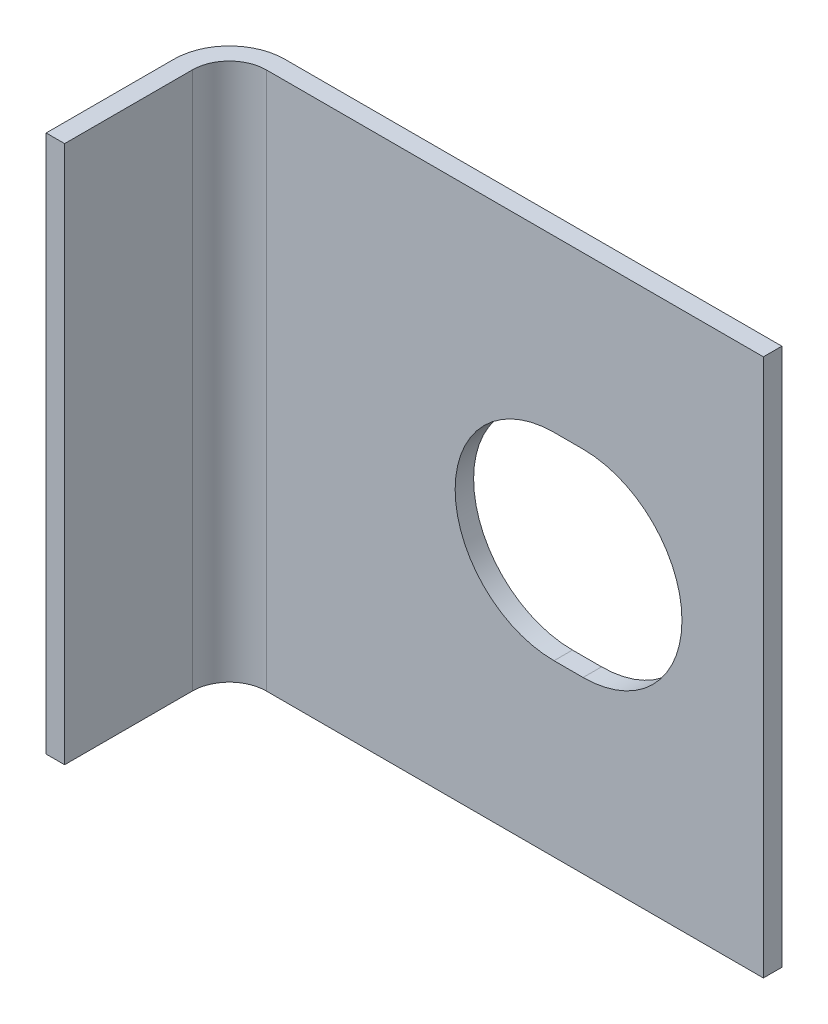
ISO-10303-21;
HEADER;
FILE_DESCRIPTION(('STEP AP214'),'2;1');
FILE_NAME('part.step','',(''),(''),'','','');
FILE_SCHEMA(('AUTOMOTIVE_DESIGN { 1 0 10303 214 1 1 1 1 }'));
ENDSEC;
DATA;
#1=APPLICATION_CONTEXT('core data for automotive mechanical design processes');
#2=APPLICATION_PROTOCOL_DEFINITION('international standard','automotive_design',2000,#1);
#3=PRODUCT_CONTEXT('',#1,'mechanical');
#4=PRODUCT('Part','Part','',(#3));
#5=PRODUCT_RELATED_PRODUCT_CATEGORY('part','',(#4));
#6=PRODUCT_DEFINITION_FORMATION('','',#4);
#7=PRODUCT_DEFINITION_CONTEXT('part definition',#1,'design');
#8=PRODUCT_DEFINITION('design','',#6,#7);
#9=PRODUCT_DEFINITION_SHAPE('','',#8);
#10=(LENGTH_UNIT() NAMED_UNIT(*) SI_UNIT(.MILLI.,.METRE.));
#11=(NAMED_UNIT(*) PLANE_ANGLE_UNIT() SI_UNIT($,.RADIAN.));
#12=(NAMED_UNIT(*) SI_UNIT($,.STERADIAN.) SOLID_ANGLE_UNIT());
#13=UNCERTAINTY_MEASURE_WITH_UNIT(LENGTH_MEASURE(1.E-05),#10,'distance_accuracy_value','');
#14=(GEOMETRIC_REPRESENTATION_CONTEXT(3) GLOBAL_UNCERTAINTY_ASSIGNED_CONTEXT((#13)) GLOBAL_UNIT_ASSIGNED_CONTEXT((#10,
#11,#12)) REPRESENTATION_CONTEXT('',''));
#15=CARTESIAN_POINT('',(0.,0.,0.));
#16=DIRECTION('',(0.,0.,1.));
#17=DIRECTION('',(1.,0.,0.));
#18=AXIS2_PLACEMENT_3D('',#15,#16,#17);
#19=CARTESIAN_POINT('',(-10.395,9.25,1.905));
#20=DIRECTION('',(0.,-1.,0.));
#21=DIRECTION('',(0.,0.,-1.));
#22=AXIS2_PLACEMENT_3D('',#19,#20,#21);
#23=CYLINDRICAL_SURFACE('',#22,1.905);
#24=CARTESIAN_POINT('',(-10.395,-9.25,1.905));
#25=DIRECTION('',(0.,1.,0.));
#26=DIRECTION('',(0.,0.,-1.));
#27=AXIS2_PLACEMENT_3D('',#24,#25,#26);
#28=CIRCLE('',#27,1.905);
#29=CARTESIAN_POINT('',(-10.395,-9.25,0.));
#30=VERTEX_POINT('',#29);
#31=CARTESIAN_POINT('',(-12.3,-9.25,1.905));
#32=VERTEX_POINT('',#31);
#33=EDGE_CURVE('E135',#30,#32,#28,.T.);
#34=ORIENTED_EDGE('',*,*,#33,.T.);
#35=DIRECTION('',(0.,-1.,0.));
#36=VECTOR('',#35,1.);
#37=CARTESIAN_POINT('',(-12.3,9.25,1.905));
#38=LINE('',#37,#36);
#39=CARTESIAN_POINT('',(-12.3,9.25,1.905));
#40=VERTEX_POINT('',#39);
#41=EDGE_CURVE('E9',#40,#32,#38,.T.);
#42=ORIENTED_EDGE('',*,*,#41,.F.);
#43=CARTESIAN_POINT('',(-10.395,9.25,1.905));
#44=DIRECTION('',(0.,1.,0.));
#45=DIRECTION('',(0.,0.,-1.));
#46=AXIS2_PLACEMENT_3D('',#43,#44,#45);
#47=CIRCLE('',#46,1.905);
#48=CARTESIAN_POINT('',(-10.395,9.25,0.));
#49=VERTEX_POINT('',#48);
#50=EDGE_CURVE('E139',#49,#40,#47,.T.);
#51=ORIENTED_EDGE('',*,*,#50,.F.);
#52=DIRECTION('',(0.,-1.,0.));
#53=VECTOR('',#52,1.);
#54=CARTESIAN_POINT('',(-10.395,9.25,0.));
#55=LINE('',#54,#53);
#56=EDGE_CURVE('E157',#49,#30,#55,.T.);
#57=ORIENTED_EDGE('',*,*,#56,.T.);
#58=EDGE_LOOP('',(#34,#42,#51,#57));
#59=FACE_BOUND('',#58,.T.);
#60=ADVANCED_FACE('F14',(#59),#23,.T.);
#61=CARTESIAN_POINT('',(-12.3,9.25,1.905));
#62=DIRECTION('',(1.,0.,0.));
#63=DIRECTION('',(0.,0.,-1.));
#64=AXIS2_PLACEMENT_3D('',#61,#62,#63);
#65=PLANE('',#64);
#66=DIRECTION('',(0.,0.,1.));
#67=VECTOR('',#66,1.);
#68=CARTESIAN_POINT('',(-12.3,-9.25,1.905));
#69=LINE('',#68,#67);
#70=CARTESIAN_POINT('',(-12.3,-9.25,6.3));
#71=VERTEX_POINT('',#70);
#72=EDGE_CURVE('E160',#32,#71,#69,.T.);
#73=ORIENTED_EDGE('',*,*,#72,.T.);
#74=DIRECTION('',(0.,-1.,0.));
#75=VECTOR('',#74,1.);
#76=CARTESIAN_POINT('',(-12.3,9.25,6.3));
#77=LINE('',#76,#75);
#78=CARTESIAN_POINT('',(-12.3,9.25,6.3));
#79=VERTEX_POINT('',#78);
#80=EDGE_CURVE('E21',#79,#71,#77,.T.);
#81=ORIENTED_EDGE('',*,*,#80,.F.);
#82=DIRECTION('',(0.,0.,1.));
#83=VECTOR('',#82,1.);
#84=CARTESIAN_POINT('',(-12.3,9.25,1.905));
#85=LINE('',#84,#83);
#86=EDGE_CURVE('E142',#40,#79,#85,.T.);
#87=ORIENTED_EDGE('',*,*,#86,.F.);
#88=ORIENTED_EDGE('',*,*,#41,.T.);
#89=EDGE_LOOP('',(#73,#81,#87,#88));
#90=FACE_BOUND('',#89,.T.);
#91=ADVANCED_FACE('F217',(#90),#65,.F.);
#92=CARTESIAN_POINT('',(-12.3,9.25,6.3));
#93=DIRECTION('',(0.,0.,-1.));
#94=DIRECTION('',(-1.,0.,0.));
#95=AXIS2_PLACEMENT_3D('',#92,#93,#94);
#96=PLANE('',#95);
#97=DIRECTION('',(1.,0.,0.));
#98=VECTOR('',#97,1.);
#99=CARTESIAN_POINT('',(-12.3,-9.25,6.3));
#100=LINE('',#99,#98);
#101=CARTESIAN_POINT('',(-11.665,-9.25,6.3));
#102=VERTEX_POINT('',#101);
#103=EDGE_CURVE('E162',#71,#102,#100,.T.);
#104=ORIENTED_EDGE('',*,*,#103,.T.);
#105=DIRECTION('',(0.,-1.,0.));
#106=VECTOR('',#105,1.);
#107=CARTESIAN_POINT('',(-11.665,9.25,6.3));
#108=LINE('',#107,#106);
#109=CARTESIAN_POINT('',(-11.665,9.25,6.3));
#110=VERTEX_POINT('',#109);
#111=EDGE_CURVE('E187',#110,#102,#108,.T.);
#112=ORIENTED_EDGE('',*,*,#111,.F.);
#113=DIRECTION('',(1.,0.,0.));
#114=VECTOR('',#113,1.);
#115=CARTESIAN_POINT('',(-12.3,9.25,6.3));
#116=LINE('',#115,#114);
#117=EDGE_CURVE('E145',#79,#110,#116,.T.);
#118=ORIENTED_EDGE('',*,*,#117,.F.);
#119=ORIENTED_EDGE('',*,*,#80,.T.);
#120=EDGE_LOOP('',(#104,#112,#118,#119));
#121=FACE_BOUND('',#120,.T.);
#122=ADVANCED_FACE('F194',(#121),#96,.F.);
#123=CARTESIAN_POINT('',(-11.665,9.25,1.905));
#124=DIRECTION('',(-1.,0.,0.));
#125=DIRECTION('',(0.,0.,1.));
#126=AXIS2_PLACEMENT_3D('',#123,#124,#125);
#127=PLANE('',#126);
#128=DIRECTION('',(0.,0.,-1.));
#129=VECTOR('',#128,1.);
#130=CARTESIAN_POINT('',(-11.665,-9.25,1.905));
#131=LINE('',#130,#129);
#132=CARTESIAN_POINT('',(-11.665,-9.25,1.905));
#133=VERTEX_POINT('',#132);
#134=EDGE_CURVE('E164',#102,#133,#131,.T.);
#135=ORIENTED_EDGE('',*,*,#134,.T.);
#136=DIRECTION('',(0.,-1.,0.));
#137=VECTOR('',#136,1.);
#138=CARTESIAN_POINT('',(-11.665,9.25,1.905));
#139=LINE('',#138,#137);
#140=CARTESIAN_POINT('',(-11.665,9.25,1.905));
#141=VERTEX_POINT('',#140);
#142=EDGE_CURVE('E184',#141,#133,#139,.T.);
#143=ORIENTED_EDGE('',*,*,#142,.F.);
#144=DIRECTION('',(0.,0.,-1.));
#145=VECTOR('',#144,1.);
#146=CARTESIAN_POINT('',(-11.665,9.25,1.905));
#147=LINE('',#146,#145);
#148=EDGE_CURVE('E147',#110,#141,#147,.T.);
#149=ORIENTED_EDGE('',*,*,#148,.F.);
#150=ORIENTED_EDGE('',*,*,#111,.T.);
#151=EDGE_LOOP('',(#135,#143,#149,#150));
#152=FACE_BOUND('',#151,.T.);
#153=ADVANCED_FACE('F205',(#152),#127,.F.);
#154=CARTESIAN_POINT('',(-10.395,9.25,1.905));
#155=DIRECTION('',(0.,-1.,0.));
#156=DIRECTION('',(0.,0.,-1.));
#157=AXIS2_PLACEMENT_3D('',#154,#155,#156);
#158=CYLINDRICAL_SURFACE('',#157,1.27);
#159=CARTESIAN_POINT('',(-10.395,-9.25,1.905));
#160=DIRECTION('',(0.,-1.,0.));
#161=DIRECTION('',(0.,0.,1.));
#162=AXIS2_PLACEMENT_3D('',#159,#160,#161);
#163=CIRCLE('',#162,1.27);
#164=CARTESIAN_POINT('',(-10.395,-9.25,0.635));
#165=VERTEX_POINT('',#164);
#166=EDGE_CURVE('E166',#133,#165,#163,.T.);
#167=ORIENTED_EDGE('',*,*,#166,.T.);
#168=DIRECTION('',(0.,-1.,0.));
#169=VECTOR('',#168,1.);
#170=CARTESIAN_POINT('',(-10.395,9.25,0.635));
#171=LINE('',#170,#169);
#172=CARTESIAN_POINT('',(-10.395,9.25,0.635));
#173=VERTEX_POINT('',#172);
#174=EDGE_CURVE('E181',#173,#165,#171,.T.);
#175=ORIENTED_EDGE('',*,*,#174,.F.);
#176=CARTESIAN_POINT('',(-10.395,9.25,1.905));
#177=DIRECTION('',(0.,-1.,0.));
#178=DIRECTION('',(0.,0.,1.));
#179=AXIS2_PLACEMENT_3D('',#176,#177,#178);
#180=CIRCLE('',#179,1.27);
#181=EDGE_CURVE('E149',#141,#173,#180,.T.);
#182=ORIENTED_EDGE('',*,*,#181,.F.);
#183=ORIENTED_EDGE('',*,*,#142,.T.);
#184=EDGE_LOOP('',(#167,#175,#182,#183));
#185=FACE_BOUND('',#184,.T.);
#186=ADVANCED_FACE('F209',(#185),#158,.F.);
#187=CARTESIAN_POINT('',(6.7,9.25,0.635));
#188=DIRECTION('',(0.,0.,-1.));
#189=DIRECTION('',(-1.,0.,0.));
#190=AXIS2_PLACEMENT_3D('',#187,#188,#189);
#191=PLANE('',#190);
#192=DIRECTION('',(-1.,0.,0.));
#193=VECTOR('',#192,1.);
#194=CARTESIAN_POINT('',(-0.5,-3.4,0.635));
#195=LINE('',#194,#193);
#196=CARTESIAN_POINT('',(0.5,-3.4,0.635));
#197=VERTEX_POINT('',#196);
#198=CARTESIAN_POINT('',(-0.5,-3.4,0.635));
#199=VERTEX_POINT('',#198);
#200=EDGE_CURVE('E110',#197,#199,#195,.T.);
#201=ORIENTED_EDGE('',*,*,#200,.T.);
#202=CARTESIAN_POINT('',(-0.5,0.,0.635));
#203=DIRECTION('',(0.,0.,-1.));
#204=DIRECTION('',(-1.,0.,0.));
#205=AXIS2_PLACEMENT_3D('',#202,#203,#204);
#206=CIRCLE('',#205,3.4);
#207=CARTESIAN_POINT('',(-0.5,3.4,0.635));
#208=VERTEX_POINT('',#207);
#209=EDGE_CURVE('E104',#199,#208,#206,.T.);
#210=ORIENTED_EDGE('',*,*,#209,.T.);
#211=DIRECTION('',(1.,0.,0.));
#212=VECTOR('',#211,1.);
#213=CARTESIAN_POINT('',(-0.5,3.4,0.635));
#214=LINE('',#213,#212);
#215=CARTESIAN_POINT('',(0.5,3.4,0.635));
#216=VERTEX_POINT('',#215);
#217=EDGE_CURVE('E113',#208,#216,#214,.T.);
#218=ORIENTED_EDGE('',*,*,#217,.T.);
#219=CARTESIAN_POINT('',(0.5,0.,0.635));
#220=DIRECTION('',(0.,0.,-1.));
#221=DIRECTION('',(-1.,0.,0.));
#222=AXIS2_PLACEMENT_3D('',#219,#220,#221);
#223=CIRCLE('',#222,3.4);
#224=EDGE_CURVE('E28',#216,#197,#223,.T.);
#225=ORIENTED_EDGE('',*,*,#224,.T.);
#226=EDGE_LOOP('',(#201,#210,#218,#225));
#227=FACE_BOUND('',#226,.T.);
#228=DIRECTION('',(1.,0.,0.));
#229=VECTOR('',#228,1.);
#230=CARTESIAN_POINT('',(6.7,-9.25,0.635));
#231=LINE('',#230,#229);
#232=CARTESIAN_POINT('',(6.7,-9.25,0.635));
#233=VERTEX_POINT('',#232);
#234=EDGE_CURVE('E168',#165,#233,#231,.T.);
#235=ORIENTED_EDGE('',*,*,#234,.T.);
#236=DIRECTION('',(0.,-1.,0.));
#237=VECTOR('',#236,1.);
#238=CARTESIAN_POINT('',(6.7,9.25,0.635));
#239=LINE('',#238,#237);
#240=CARTESIAN_POINT('',(6.7,9.25,0.635));
#241=VERTEX_POINT('',#240);
#242=EDGE_CURVE('E178',#241,#233,#239,.T.);
#243=ORIENTED_EDGE('',*,*,#242,.F.);
#244=DIRECTION('',(1.,0.,0.));
#245=VECTOR('',#244,1.);
#246=CARTESIAN_POINT('',(6.7,9.25,0.635));
#247=LINE('',#246,#245);
#248=EDGE_CURVE('E151',#173,#241,#247,.T.);
#249=ORIENTED_EDGE('',*,*,#248,.F.);
#250=ORIENTED_EDGE('',*,*,#174,.T.);
#251=EDGE_LOOP('',(#235,#243,#249,#250));
#252=FACE_BOUND('',#251,.T.);
#253=ADVANCED_FACE('F117',(#227,#252),#191,.F.);
#254=CARTESIAN_POINT('',(6.7,9.25,0.635));
#255=DIRECTION('',(-1.,0.,0.));
#256=DIRECTION('',(0.,0.,1.));
#257=AXIS2_PLACEMENT_3D('',#254,#255,#256);
#258=PLANE('',#257);
#259=DIRECTION('',(0.,0.,-1.));
#260=VECTOR('',#259,1.);
#261=CARTESIAN_POINT('',(6.7,-9.25,0.635));
#262=LINE('',#261,#260);
#263=CARTESIAN_POINT('',(6.7,-9.25,0.));
#264=VERTEX_POINT('',#263);
#265=EDGE_CURVE('E170',#233,#264,#262,.T.);
#266=ORIENTED_EDGE('',*,*,#265,.T.);
#267=DIRECTION('',(0.,-1.,0.));
#268=VECTOR('',#267,1.);
#269=CARTESIAN_POINT('',(6.7,9.25,0.));
#270=LINE('',#269,#268);
#271=CARTESIAN_POINT('',(6.7,9.25,0.));
#272=VERTEX_POINT('',#271);
#273=EDGE_CURVE('E175',#272,#264,#270,.T.);
#274=ORIENTED_EDGE('',*,*,#273,.F.);
#275=DIRECTION('',(0.,0.,-1.));
#276=VECTOR('',#275,1.);
#277=CARTESIAN_POINT('',(6.7,9.25,0.635));
#278=LINE('',#277,#276);
#279=EDGE_CURVE('E153',#241,#272,#278,.T.);
#280=ORIENTED_EDGE('',*,*,#279,.F.);
#281=ORIENTED_EDGE('',*,*,#242,.T.);
#282=EDGE_LOOP('',(#266,#274,#280,#281));
#283=FACE_BOUND('',#282,.T.);
#284=ADVANCED_FACE('F228',(#283),#258,.F.);
#285=CARTESIAN_POINT('',(6.7,9.25,0.));
#286=DIRECTION('',(0.,0.,1.));
#287=DIRECTION('',(1.,0.,0.));
#288=AXIS2_PLACEMENT_3D('',#285,#286,#287);
#289=PLANE('',#288);
#290=DIRECTION('',(1.,0.,0.));
#291=VECTOR('',#290,1.);
#292=CARTESIAN_POINT('',(-0.5,3.4,0.));
#293=LINE('',#292,#291);
#294=CARTESIAN_POINT('',(-0.5,3.4,0.));
#295=VERTEX_POINT('',#294);
#296=CARTESIAN_POINT('',(0.5,3.4,0.));
#297=VERTEX_POINT('',#296);
#298=EDGE_CURVE('E129',#295,#297,#293,.T.);
#299=ORIENTED_EDGE('',*,*,#298,.F.);
#300=CARTESIAN_POINT('',(-0.5,0.,0.));
#301=DIRECTION('',(0.,0.,-1.));
#302=DIRECTION('',(-1.,0.,0.));
#303=AXIS2_PLACEMENT_3D('',#300,#301,#302);
#304=CIRCLE('',#303,3.4);
#305=CARTESIAN_POINT('',(-0.5,-3.4,0.));
#306=VERTEX_POINT('',#305);
#307=EDGE_CURVE('E36',#306,#295,#304,.T.);
#308=ORIENTED_EDGE('',*,*,#307,.F.);
#309=DIRECTION('',(-1.,0.,0.));
#310=VECTOR('',#309,1.);
#311=CARTESIAN_POINT('',(-0.5,-3.4,0.));
#312=LINE('',#311,#310);
#313=CARTESIAN_POINT('',(0.5,-3.4,0.));
#314=VERTEX_POINT('',#313);
#315=EDGE_CURVE('E120',#314,#306,#312,.T.);
#316=ORIENTED_EDGE('',*,*,#315,.F.);
#317=CARTESIAN_POINT('',(0.5,0.,0.));
#318=DIRECTION('',(0.,0.,-1.));
#319=DIRECTION('',(-1.,0.,0.));
#320=AXIS2_PLACEMENT_3D('',#317,#318,#319);
#321=CIRCLE('',#320,3.4);
#322=EDGE_CURVE('E123',#297,#314,#321,.T.);
#323=ORIENTED_EDGE('',*,*,#322,.F.);
#324=EDGE_LOOP('',(#299,#308,#316,#323));
#325=FACE_BOUND('',#324,.T.);
#326=DIRECTION('',(-1.,0.,0.));
#327=VECTOR('',#326,1.);
#328=CARTESIAN_POINT('',(6.7,-9.25,0.));
#329=LINE('',#328,#327);
#330=EDGE_CURVE('E143',#264,#30,#329,.T.);
#331=ORIENTED_EDGE('',*,*,#330,.T.);
#332=ORIENTED_EDGE('',*,*,#56,.F.);
#333=DIRECTION('',(-1.,0.,0.));
#334=VECTOR('',#333,1.);
#335=CARTESIAN_POINT('',(6.7,9.25,0.));
#336=LINE('',#335,#334);
#337=EDGE_CURVE('E155',#272,#49,#336,.T.);
#338=ORIENTED_EDGE('',*,*,#337,.F.);
#339=ORIENTED_EDGE('',*,*,#273,.T.);
#340=EDGE_LOOP('',(#331,#332,#338,#339));
#341=FACE_BOUND('',#340,.T.);
#342=ADVANCED_FACE('F223',(#325,#341),#289,.F.);
#343=CARTESIAN_POINT('',(-10.395,9.25,1.905));
#344=DIRECTION('',(0.,-1.,0.));
#345=DIRECTION('',(0.,0.,-1.));
#346=AXIS2_PLACEMENT_3D('',#343,#344,#345);
#347=PLANE('',#346);
#348=ORIENTED_EDGE('',*,*,#50,.T.);
#349=ORIENTED_EDGE('',*,*,#86,.T.);
#350=ORIENTED_EDGE('',*,*,#117,.T.);
#351=ORIENTED_EDGE('',*,*,#148,.T.);
#352=ORIENTED_EDGE('',*,*,#181,.T.);
#353=ORIENTED_EDGE('',*,*,#248,.T.);
#354=ORIENTED_EDGE('',*,*,#279,.T.);
#355=ORIENTED_EDGE('',*,*,#337,.T.);
#356=EDGE_LOOP('',(#348,#349,#350,#351,#352,#353,#354,#355));
#357=FACE_BOUND('',#356,.T.);
#358=ADVANCED_FACE('F213',(#357),#347,.F.);
#359=CARTESIAN_POINT('',(-10.395,-9.25,1.905));
#360=DIRECTION('',(0.,-1.,0.));
#361=DIRECTION('',(0.,0.,-1.));
#362=AXIS2_PLACEMENT_3D('',#359,#360,#361);
#363=PLANE('',#362);
#364=ORIENTED_EDGE('',*,*,#33,.F.);
#365=ORIENTED_EDGE('',*,*,#330,.F.);
#366=ORIENTED_EDGE('',*,*,#265,.F.);
#367=ORIENTED_EDGE('',*,*,#234,.F.);
#368=ORIENTED_EDGE('',*,*,#166,.F.);
#369=ORIENTED_EDGE('',*,*,#134,.F.);
#370=ORIENTED_EDGE('',*,*,#103,.F.);
#371=ORIENTED_EDGE('',*,*,#72,.F.);
#372=EDGE_LOOP('',(#364,#365,#366,#367,#368,#369,#370,#371));
#373=FACE_BOUND('',#372,.T.);
#374=ADVANCED_FACE('F200',(#373),#363,.T.);
#375=CARTESIAN_POINT('',(-0.5,0.,0.635));
#376=DIRECTION('',(0.,0.,-1.));
#377=DIRECTION('',(-1.,0.,0.));
#378=AXIS2_PLACEMENT_3D('',#375,#376,#377);
#379=CYLINDRICAL_SURFACE('',#378,3.4);
#380=ORIENTED_EDGE('',*,*,#307,.T.);
#381=DIRECTION('',(0.,0.,-1.));
#382=VECTOR('',#381,1.);
#383=CARTESIAN_POINT('',(-0.5,3.4,0.635));
#384=LINE('',#383,#382);
#385=EDGE_CURVE('E100',#208,#295,#384,.T.);
#386=ORIENTED_EDGE('',*,*,#385,.F.);
#387=ORIENTED_EDGE('',*,*,#209,.F.);
#388=DIRECTION('',(0.,0.,-1.));
#389=VECTOR('',#388,1.);
#390=CARTESIAN_POINT('',(-0.5,-3.4,0.635));
#391=LINE('',#390,#389);
#392=EDGE_CURVE('E133',#199,#306,#391,.T.);
#393=ORIENTED_EDGE('',*,*,#392,.T.);
#394=EDGE_LOOP('',(#380,#386,#387,#393));
#395=FACE_BOUND('',#394,.T.);
#396=ADVANCED_FACE('F102',(#395),#379,.F.);
#397=CARTESIAN_POINT('',(-0.5,-3.4,0.635));
#398=DIRECTION('',(0.,-1.,0.));
#399=DIRECTION('',(0.,0.,-1.));
#400=AXIS2_PLACEMENT_3D('',#397,#398,#399);
#401=PLANE('',#400);
#402=ORIENTED_EDGE('',*,*,#315,.T.);
#403=ORIENTED_EDGE('',*,*,#392,.F.);
#404=ORIENTED_EDGE('',*,*,#200,.F.);
#405=DIRECTION('',(0.,0.,-1.));
#406=VECTOR('',#405,1.);
#407=CARTESIAN_POINT('',(0.5,-3.4,0.635));
#408=LINE('',#407,#406);
#409=EDGE_CURVE('E136',#197,#314,#408,.T.);
#410=ORIENTED_EDGE('',*,*,#409,.T.);
#411=EDGE_LOOP('',(#402,#403,#404,#410));
#412=FACE_BOUND('',#411,.T.);
#413=ADVANCED_FACE('F318',(#412),#401,.F.);
#414=CARTESIAN_POINT('',(0.5,0.,0.635));
#415=DIRECTION('',(0.,0.,-1.));
#416=DIRECTION('',(-1.,0.,0.));
#417=AXIS2_PLACEMENT_3D('',#414,#415,#416);
#418=CYLINDRICAL_SURFACE('',#417,3.4);
#419=ORIENTED_EDGE('',*,*,#322,.T.);
#420=ORIENTED_EDGE('',*,*,#409,.F.);
#421=ORIENTED_EDGE('',*,*,#224,.F.);
#422=DIRECTION('',(0.,0.,-1.));
#423=VECTOR('',#422,1.);
#424=CARTESIAN_POINT('',(0.5,3.4,0.635));
#425=LINE('',#424,#423);
#426=EDGE_CURVE('E109',#216,#297,#425,.T.);
#427=ORIENTED_EDGE('',*,*,#426,.T.);
#428=EDGE_LOOP('',(#419,#420,#421,#427));
#429=FACE_BOUND('',#428,.T.);
#430=ADVANCED_FACE('F326',(#429),#418,.F.);
#431=CARTESIAN_POINT('',(-0.5,3.4,0.635));
#432=DIRECTION('',(0.,1.,0.));
#433=DIRECTION('',(0.,0.,1.));
#434=AXIS2_PLACEMENT_3D('',#431,#432,#433);
#435=PLANE('',#434);
#436=ORIENTED_EDGE('',*,*,#298,.T.);
#437=ORIENTED_EDGE('',*,*,#426,.F.);
#438=ORIENTED_EDGE('',*,*,#217,.F.);
#439=ORIENTED_EDGE('',*,*,#385,.T.);
#440=EDGE_LOOP('',(#436,#437,#438,#439));
#441=FACE_BOUND('',#440,.T.);
#442=ADVANCED_FACE('F114',(#441),#435,.F.);
#443=CLOSED_SHELL('',(#60,#91,#122,#153,#186,#253,#284,#342,#358,#374,#396,#413,#430,#442));
#444=MANIFOLD_SOLID_BREP('B1',#443);
#445=ADVANCED_BREP_SHAPE_REPRESENTATION('',(#18,#444),#14);
#446=SHAPE_DEFINITION_REPRESENTATION(#9,#445);
ENDSEC;
END-ISO-10303-21;
